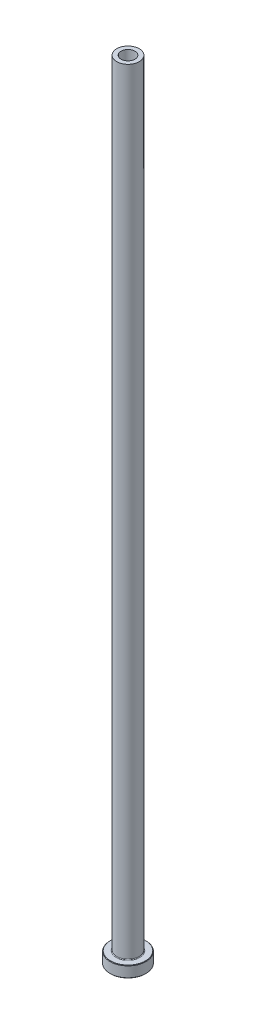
from build123d import *

# Parameters (mm, degrees)
FILLET1_R     = 0.3
CHAMFER1_SIZE = 0.2
CHAMFER3_SIZE = 0.5


with BuildPart() as part:
    # Sketch1 → Revolve1 (revolve)
    with BuildSketch(Plane.XY, mode=Mode.PRIVATE) as revolve1_sk:
        Polygon((-3.1, 350), (-5, 350), (-5, 5), (-8, 5), (-8, 0), (-3.35, 0), (-3.35, 293), (-3.1, 305), align=None)
    revolve(revolve1_sk.sketch.rotate(Axis((0, 92.187680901, 0), (0, -1, 0)), 270), axis=Axis((0, 92.187680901, 0), (0, -1, 0)))

    # Fillet1
    fillet1_edges = [part.edges().sort_by_distance(p)[0] for p in [
        (0, 5, -5),
    ]]
    fillet(fillet1_edges, radius=FILLET1_R)

    # Chamfer1
    chamfer1_edges = [part.edges().sort_by_distance(p)[0] for p in [
        (0, 0, -8),
        (0, 5, -8),
    ]]
    chamfer(chamfer1_edges, length=CHAMFER1_SIZE)

    # Chamfer3
    chamfer3_edges = [part.edges().sort_by_distance(p)[0] for p in [
        (0, 0, -3.35),
    ]]
    chamfer(chamfer3_edges, length=CHAMFER3_SIZE)


solid = part.part
